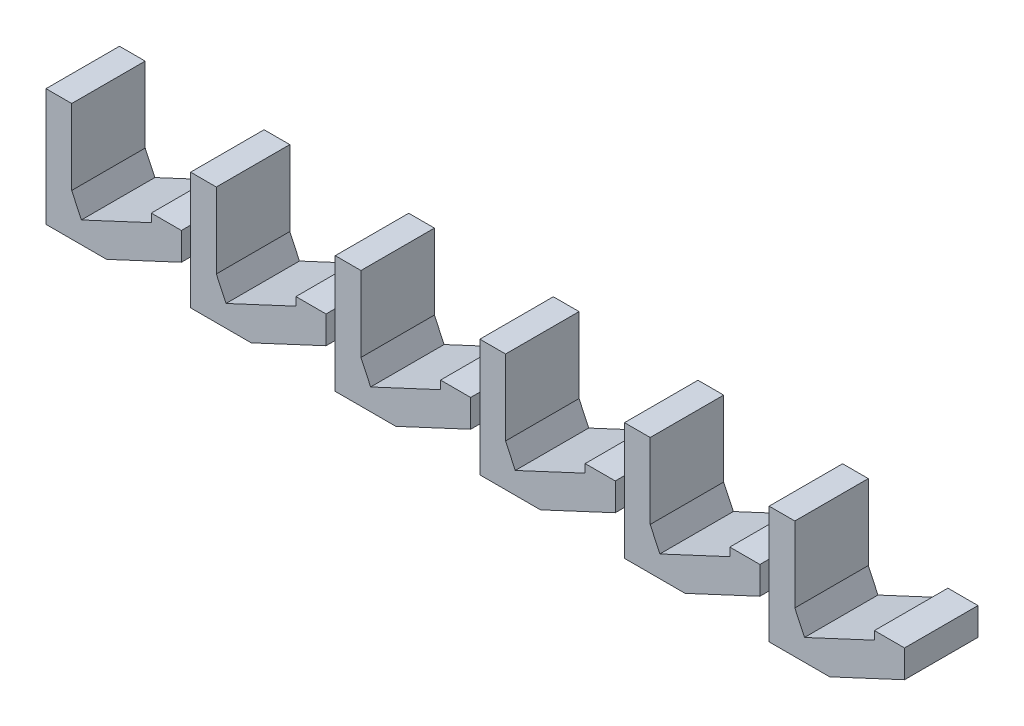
from build123d import *

# Parameters (mm, degrees)
EXTRUDE1_DEPTH     = 25.4
CUT_EXTRUDE1_DEPTH = 151.082513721
LPATTERN1_COUNT    = 6
LPATTERN1_PITCH    = 50


with BuildPart() as part:
    # Sketch3 → Extrude1 (new body)
    with BuildSketch(Plane.XY):
        Polygon((109.501077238, 80.394029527), (109.501077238, 58.804029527), (62.68533415, 58.804029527), (62.68533415, 99.444029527), (71.57533415, 99.444029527), (71.57533415, 73.409029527), (73.574035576, 69.122800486), (74.915848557, 66.245273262), (99.087077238, 77.516502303), (99.087077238, 80.394029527), align=None)
    extrude(amount=EXTRUDE1_DEPTH)

    # Sketch8 → Cut-Extrude1 (cut, through all)
    with BuildSketch(Plane.XY.offset(25.4)):
        Polygon((109.501077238, 70.869029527), (83.627601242, 58.804029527), (109.501077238, 58.804029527), align=None)
    extrude(amount=-CUT_EXTRUDE1_DEPTH, mode=Mode.SUBTRACT)


with BuildPart() as lpattern1_1:
    # LPattern1: pattern copy
    add(part.part.moved(Location(Vector(-1, 0, 0) * (1 * LPATTERN1_PITCH))))


with BuildPart() as lpattern1_2:
    # LPattern1: pattern copy
    add(part.part.moved(Location(Vector(-1, 0, 0) * (2 * LPATTERN1_PITCH))))


with BuildPart() as lpattern1_3:
    # LPattern1: pattern copy
    add(part.part.moved(Location(Vector(-1, 0, 0) * (3 * LPATTERN1_PITCH))))


with BuildPart() as lpattern1_4:
    # LPattern1: pattern copy
    add(part.part.moved(Location(Vector(-1, 0, 0) * (4 * LPATTERN1_PITCH))))


with BuildPart() as lpattern1_5:
    # LPattern1: pattern copy
    add(part.part.moved(Location(Vector(-1, 0, 0) * (5 * LPATTERN1_PITCH))))


solid = Compound([part.part, lpattern1_1.part, lpattern1_2.part, lpattern1_3.part, lpattern1_4.part, lpattern1_5.part])
